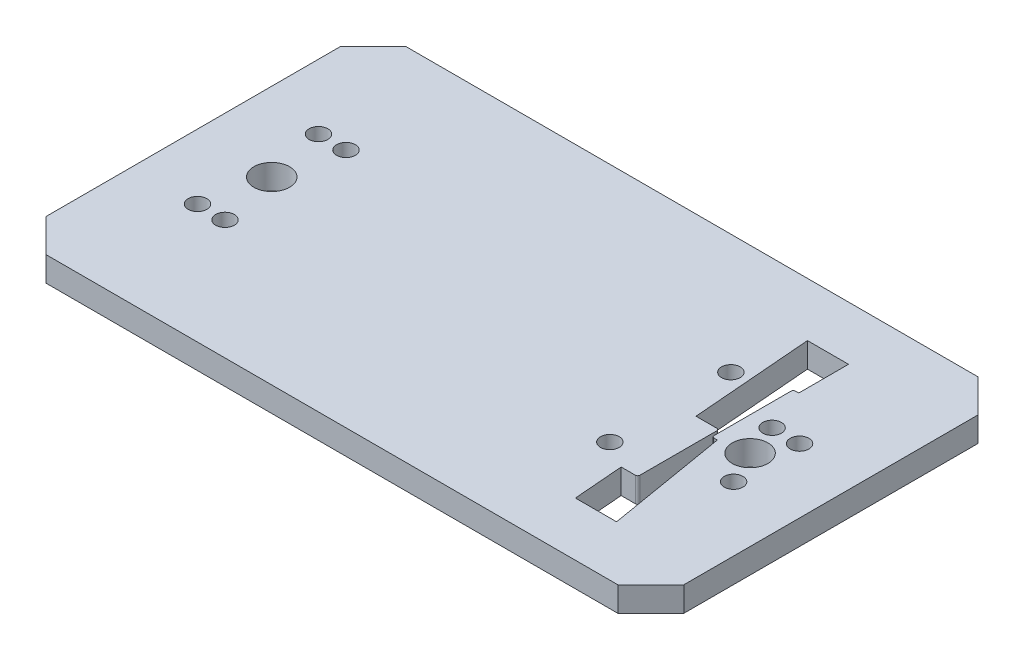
from build123d import *

# Parameters (mm, degrees)
SKETCH11_R          = 3.25
SKETCH11_R_2        = 1.7
BOSS_EXTRUDE4_DEPTH = 4.5


with BuildPart() as part:
    # Sketch11 → Boss-Extrude4 (new body)
    with BuildSketch(Plane(origin=(0, 0, 0), x_dir=(1, 0, 0), z_dir=(0, 1, 0))):
        Polygon((-47, 32.75), (-53, 26.75), (-53, -26.75), (-47, -32.75), (57, -32.75), (63, -26.75), (63, 26.75), (57, 32.75), align=None)
        with Locations(Location((-38.7, 0, 0), (0, 0, 270))):
            Circle(SKETCH11_R, mode=Mode.SUBTRACT)
        with Locations(Location((-41.2, 11, 0), (0, 0, 270))):
            Circle(SKETCH11_R_2, mode=Mode.SUBTRACT)
        with Locations(Location((48.3, 0, 0), (0, 0, 270))):
            Circle(SKETCH11_R, mode=Mode.SUBTRACT)
        with Locations(Location((-41.2, -11, 0), (0, 0, 270))):
            Circle(SKETCH11_R_2, mode=Mode.SUBTRACT)
        with Locations(Location((-36.2, 11, 0), (0, 0, 270))):
            Circle(SKETCH11_R_2, mode=Mode.SUBTRACT)
        with Locations(Location((-36.2, -11, 0), (0, 0, 270))):
            Circle(SKETCH11_R_2, mode=Mode.SUBTRACT)
        with Locations(Location((33.8, 11, 0), (0, 0, 270))):
            Circle(SKETCH11_R_2, mode=Mode.SUBTRACT)
        with Locations(Location((33.8, -11, 0), (0, 0, 270))):
            Circle(SKETCH11_R_2, mode=Mode.SUBTRACT)
        with Locations(Location((46.3, 6, 0), (0, 0, 270))):
            Circle(SKETCH11_R_2, mode=Mode.SUBTRACT)
        with Locations(Location((51.3, 6, 0), (0, 0, 270))):
            Circle(SKETCH11_R_2, mode=Mode.SUBTRACT)
        with Locations(Location((51.3, -6, 0), (0, 0, 270))):
            Circle(SKETCH11_R_2, mode=Mode.SUBTRACT)
        with BuildLine():
            Line((41.75, -13.5), (41.75, 0.5))
            ThreePointArc((41.75, 0.5), (41.632842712, 0.782842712), (41.35, 0.9))
            Line((41.35, 0.9), (37.561166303, 0.9))
            Line((37.561166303, 0.9), (35.78322444, 22.95))
            Line((35.78322444, 22.95), (43.25, 22.95))
            Line((43.25, 22.95), (43.25, 13.9))
            Line((43.25, 13.9), (42.65, 13.9))
            ThreePointArc((42.65, 13.9), (42.367157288, 13.782842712), (42.25, 13.5))
            Line((42.25, 13.5), (42.25, -0.5))
            ThreePointArc((42.25, -0.5), (42.367157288, -0.782842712), (42.65, -0.9))
            Line((42.65, -0.9), (43.25, -0.9))
            Line((43.25, -0.9), (46.966292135, -22.95))
            Line((46.966292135, -22.95), (39.484246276, -22.95))
            Line((39.484246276, -22.95), (38.754524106, -13.9))
            Line((38.754524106, -13.9), (41.35, -13.9))
            ThreePointArc((41.35, -13.9), (41.632842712, -13.782842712), (41.75, -13.5))
        make_face(mode=Mode.SUBTRACT)
    extrude(amount=BOSS_EXTRUDE4_DEPTH)


solid = part.part
